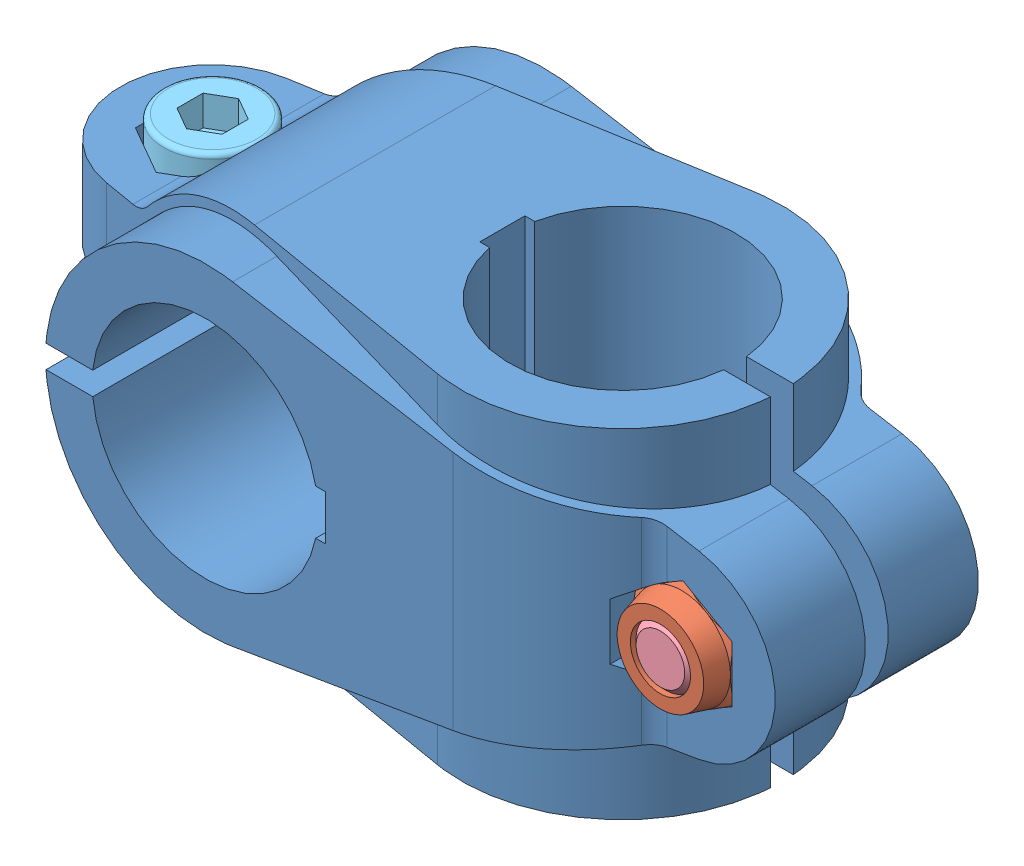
SolidWorks assembly TCC30-CR-G.sldasm, configuration Default (file format 15000). Lengths in mm.
Overall size (100.5 45.01 45.01).
5 component instances, 5 part files, 0 mates.
Components (placement in the parent):
- TCC30-CR-G_01-1: TCC30-CR-G_01.sldprt [ﾃﾞﾌｫﾙﾄ] at (16.5 0 0) x (1 0 0) z (0 1 0) size (100.5 45.01 45.01)
- TCC30-CR-G_02-1: TCC30-CR-G_02.sldprt [ﾃﾞﾌｫﾙﾄ] at (54.5 0 8.5) x (-0.866025 -0.5 0) z (-0.5 0.866025 0) size (17.77 8.01 17.77)
- TCC30-CR-G_03-1: TCC30-CR-G_03.sldprt [ﾃﾞﾌｫﾙﾄ] at (-21.5 -8.5 0) x (0.866025 0 -0.5) z (-0.5 0 -0.866025) size (17.77 8.01 17.77)
- TCC30-CR-G_04-1: TCC30-CR-G_04.sldprt [ﾃﾞﾌｫﾙﾄ] at (54.5 0 -8.5) x (0.866025 -0.5 0) z (0.5 0.866025 0) size (13 33 13)
- TCC30-CR-G_05-1: TCC30-CR-G_05.sldprt [ﾃﾞﾌｫﾙﾄ] at (-21.5 8.5 0) x (0.866025 0 -0.5) z (0.5 0 0.866025) size (13 33 13)
